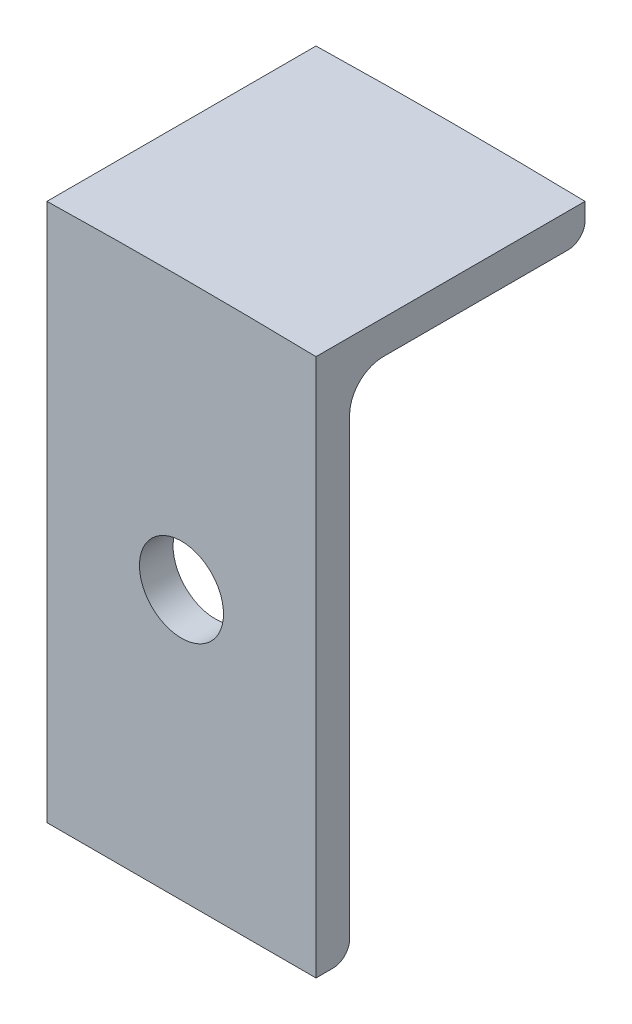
ISO-10303-21;
HEADER;
FILE_DESCRIPTION(('STEP AP214'),'2;1');
FILE_NAME('part.step','',(''),(''),'','','');
FILE_SCHEMA(('AUTOMOTIVE_DESIGN { 1 0 10303 214 1 1 1 1 }'));
ENDSEC;
DATA;
#1=APPLICATION_CONTEXT('core data for automotive mechanical design processes');
#2=APPLICATION_PROTOCOL_DEFINITION('international standard','automotive_design',2000,#1);
#3=PRODUCT_CONTEXT('',#1,'mechanical');
#4=PRODUCT('Part','Part','',(#3));
#5=PRODUCT_RELATED_PRODUCT_CATEGORY('part','',(#4));
#6=PRODUCT_DEFINITION_FORMATION('','',#4);
#7=PRODUCT_DEFINITION_CONTEXT('part definition',#1,'design');
#8=PRODUCT_DEFINITION('design','',#6,#7);
#9=PRODUCT_DEFINITION_SHAPE('','',#8);
#10=(LENGTH_UNIT() NAMED_UNIT(*) SI_UNIT(.MILLI.,.METRE.));
#11=(NAMED_UNIT(*) PLANE_ANGLE_UNIT() SI_UNIT($,.RADIAN.));
#12=(NAMED_UNIT(*) SI_UNIT($,.STERADIAN.) SOLID_ANGLE_UNIT());
#13=UNCERTAINTY_MEASURE_WITH_UNIT(LENGTH_MEASURE(1.E-05),#10,'distance_accuracy_value','');
#14=(GEOMETRIC_REPRESENTATION_CONTEXT(3) GLOBAL_UNCERTAINTY_ASSIGNED_CONTEXT((#13)) GLOBAL_UNIT_ASSIGNED_CONTEXT((#10,
#11,#12)) REPRESENTATION_CONTEXT('',''));
#15=CARTESIAN_POINT('',(0.,0.,0.));
#16=DIRECTION('',(0.,0.,1.));
#17=DIRECTION('',(1.,0.,0.));
#18=AXIS2_PLACEMENT_3D('',#15,#16,#17);
#19=CARTESIAN_POINT('',(12.7,0.,0.));
#20=DIRECTION('',(0.,0.,-1.));
#21=DIRECTION('',(-1.,0.,0.));
#22=AXIS2_PLACEMENT_3D('',#19,#20,#21);
#23=PLANE('',#22);
#24=DIRECTION('',(0.,-1.,0.));
#25=VECTOR('',#24,1.);
#26=CARTESIAN_POINT('',(-12.7,0.,0.));
#27=LINE('',#26,#25);
#28=CARTESIAN_POINT('',(-12.7,50.8,0.));
#29=VERTEX_POINT('',#28);
#30=CARTESIAN_POINT('',(-12.7,0.,0.));
#31=VERTEX_POINT('',#30);
#32=EDGE_CURVE('E87',#29,#31,#27,.T.);
#33=ORIENTED_EDGE('',*,*,#32,.T.);
#34=DIRECTION('',(-1.,0.,0.));
#35=VECTOR('',#34,1.);
#36=CARTESIAN_POINT('',(12.7,0.,0.));
#37=LINE('',#36,#35);
#38=CARTESIAN_POINT('',(12.7,0.,0.));
#39=VERTEX_POINT('',#38);
#40=EDGE_CURVE('E150',#39,#31,#37,.T.);
#41=ORIENTED_EDGE('',*,*,#40,.F.);
#42=DIRECTION('',(0.,-1.,0.));
#43=VECTOR('',#42,1.);
#44=CARTESIAN_POINT('',(12.7,0.,0.));
#45=LINE('',#44,#43);
#46=CARTESIAN_POINT('',(12.7,50.8,0.));
#47=VERTEX_POINT('',#46);
#48=EDGE_CURVE('E50',#47,#39,#45,.T.);
#49=ORIENTED_EDGE('',*,*,#48,.F.);
#50=CARTESIAN_POINT('',(0.,-552.316300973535,0.));
#51=DIRECTION('',(0.,0.,1.));
#52=DIRECTION('',(-1.,0.,0.));
#53=AXIS2_PLACEMENT_3D('',#50,#51,#52);
#54=CIRCLE('',#53,603.25);
#55=EDGE_CURVE('E126',#47,#29,#54,.T.);
#56=ORIENTED_EDGE('',*,*,#55,.T.);
#57=EDGE_LOOP('',(#33,#41,#49,#56));
#58=FACE_BOUND('',#57,.T.);
#59=CARTESIAN_POINT('',(0.,25.4,0.));
#60=DIRECTION('',(0.,0.,1.));
#61=DIRECTION('',(1.,0.,0.));
#62=AXIS2_PLACEMENT_3D('',#59,#60,#61);
#63=CIRCLE('',#62,3.96874999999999);
#64=CARTESIAN_POINT('',(3.96874999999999,25.4,0.));
#65=VERTEX_POINT('',#64);
#66=EDGE_CURVE('E129',#65,#65,#63,.T.);
#67=ORIENTED_EDGE('',*,*,#66,.F.);
#68=EDGE_LOOP('',(#67));
#69=FACE_BOUND('',#68,.T.);
#70=ADVANCED_FACE('F33',(#58,#69),#23,.F.);
#71=CARTESIAN_POINT('',(12.7,0.,-1.58749999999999));
#72=DIRECTION('',(0.,1.,0.));
#73=DIRECTION('',(0.,0.,1.));
#74=AXIS2_PLACEMENT_3D('',#71,#72,#73);
#75=PLANE('',#74);
#76=DIRECTION('',(0.,0.,-1.));
#77=VECTOR('',#76,1.);
#78=CARTESIAN_POINT('',(-12.7,0.,-1.58749999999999));
#79=LINE('',#78,#77);
#80=CARTESIAN_POINT('',(-12.7,0.,-1.58749999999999));
#81=VERTEX_POINT('',#80);
#82=EDGE_CURVE('E138',#31,#81,#79,.T.);
#83=ORIENTED_EDGE('',*,*,#82,.T.);
#84=DIRECTION('',(-1.,0.,0.));
#85=VECTOR('',#84,1.);
#86=CARTESIAN_POINT('',(12.7,0.,-1.58749999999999));
#87=LINE('',#86,#85);
#88=CARTESIAN_POINT('',(12.7,0.,-1.58749999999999));
#89=VERTEX_POINT('',#88);
#90=EDGE_CURVE('E11',#89,#81,#87,.T.);
#91=ORIENTED_EDGE('',*,*,#90,.F.);
#92=DIRECTION('',(0.,0.,-1.));
#93=VECTOR('',#92,1.);
#94=CARTESIAN_POINT('',(12.7,0.,-1.58749999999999));
#95=LINE('',#94,#93);
#96=EDGE_CURVE('E139',#39,#89,#95,.T.);
#97=ORIENTED_EDGE('',*,*,#96,.F.);
#98=ORIENTED_EDGE('',*,*,#40,.T.);
#99=EDGE_LOOP('',(#83,#91,#97,#98));
#100=FACE_BOUND('',#99,.T.);
#101=ADVANCED_FACE('F35',(#100),#75,.F.);
#102=CARTESIAN_POINT('',(12.7,1.5875,-1.5875));
#103=DIRECTION('',(-1.,0.,0.));
#104=DIRECTION('',(0.,0.,1.));
#105=AXIS2_PLACEMENT_3D('',#102,#103,#104);
#106=CYLINDRICAL_SURFACE('',#105,1.5875);
#107=CARTESIAN_POINT('',(-12.7,1.5875,-1.5875));
#108=DIRECTION('',(1.,0.,0.));
#109=DIRECTION('',(0.,0.,1.));
#110=AXIS2_PLACEMENT_3D('',#107,#108,#109);
#111=CIRCLE('',#110,1.5875);
#112=CARTESIAN_POINT('',(-12.7,1.58750000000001,-3.175));
#113=VERTEX_POINT('',#112);
#114=EDGE_CURVE('E153',#81,#113,#111,.T.);
#115=ORIENTED_EDGE('',*,*,#114,.T.);
#116=DIRECTION('',(-1.,0.,0.));
#117=VECTOR('',#116,1.);
#118=CARTESIAN_POINT('',(12.7,1.58750000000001,-3.175));
#119=LINE('',#118,#117);
#120=CARTESIAN_POINT('',(12.7,1.58750000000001,-3.175));
#121=VERTEX_POINT('',#120);
#122=EDGE_CURVE('E42',#121,#113,#119,.T.);
#123=ORIENTED_EDGE('',*,*,#122,.F.);
#124=CARTESIAN_POINT('',(12.7,1.5875,-1.5875));
#125=DIRECTION('',(1.,0.,0.));
#126=DIRECTION('',(0.,0.,1.));
#127=AXIS2_PLACEMENT_3D('',#124,#125,#126);
#128=CIRCLE('',#127,1.5875);
#129=EDGE_CURVE('E95',#89,#121,#128,.T.);
#130=ORIENTED_EDGE('',*,*,#129,.F.);
#131=ORIENTED_EDGE('',*,*,#90,.T.);
#132=EDGE_LOOP('',(#115,#123,#130,#131));
#133=FACE_BOUND('',#132,.T.);
#134=ADVANCED_FACE('F201',(#133),#106,.T.);
#135=CARTESIAN_POINT('',(12.7,44.45,-3.17499999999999));
#136=DIRECTION('',(0.,0.,1.));
#137=DIRECTION('',(0.,-1.,0.));
#138=AXIS2_PLACEMENT_3D('',#135,#136,#137);
#139=PLANE('',#138);
#140=CARTESIAN_POINT('',(0.,25.4,-3.17499999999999));
#141=DIRECTION('',(0.,0.,1.));
#142=DIRECTION('',(0.,-1.,0.));
#143=AXIS2_PLACEMENT_3D('',#140,#141,#142);
#144=CIRCLE('',#143,3.96874999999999);
#145=CARTESIAN_POINT('',(0.,21.43125,-3.175));
#146=VERTEX_POINT('',#145);
#147=EDGE_CURVE('E132',#146,#146,#144,.T.);
#148=ORIENTED_EDGE('',*,*,#147,.T.);
#149=EDGE_LOOP('',(#148));
#150=FACE_BOUND('',#149,.T.);
#151=DIRECTION('',(0.,1.,0.));
#152=VECTOR('',#151,1.);
#153=CARTESIAN_POINT('',(-12.7,44.45,-3.17499999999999));
#154=LINE('',#153,#152);
#155=CARTESIAN_POINT('',(-12.7,44.45,-3.17499999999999));
#156=VERTEX_POINT('',#155);
#157=EDGE_CURVE('E155',#113,#156,#154,.T.);
#158=ORIENTED_EDGE('',*,*,#157,.T.);
#159=DIRECTION('',(-1.,0.,0.));
#160=VECTOR('',#159,1.);
#161=CARTESIAN_POINT('',(12.7,44.45,-3.17499999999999));
#162=LINE('',#161,#160);
#163=CARTESIAN_POINT('',(12.7,44.45,-3.17499999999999));
#164=VERTEX_POINT('',#163);
#165=EDGE_CURVE('E176',#164,#156,#162,.T.);
#166=ORIENTED_EDGE('',*,*,#165,.F.);
#167=DIRECTION('',(0.,1.,0.));
#168=VECTOR('',#167,1.);
#169=CARTESIAN_POINT('',(12.7,44.45,-3.17499999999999));
#170=LINE('',#169,#168);
#171=EDGE_CURVE('E142',#121,#164,#170,.T.);
#172=ORIENTED_EDGE('',*,*,#171,.F.);
#173=ORIENTED_EDGE('',*,*,#122,.T.);
#174=EDGE_LOOP('',(#158,#166,#172,#173));
#175=FACE_BOUND('',#174,.T.);
#176=ADVANCED_FACE('F182',(#150,#175),#139,.F.);
#177=CARTESIAN_POINT('',(12.7,44.45,-6.34999999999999));
#178=DIRECTION('',(-1.,0.,0.));
#179=DIRECTION('',(0.,0.,1.));
#180=AXIS2_PLACEMENT_3D('',#177,#178,#179);
#181=CYLINDRICAL_SURFACE('',#180,3.175);
#182=CARTESIAN_POINT('',(-12.7,44.45,-6.34999999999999));
#183=DIRECTION('',(-1.,0.,0.));
#184=DIRECTION('',(0.,0.,-1.));
#185=AXIS2_PLACEMENT_3D('',#182,#183,#184);
#186=CIRCLE('',#185,3.175);
#187=CARTESIAN_POINT('',(-12.7,47.625,-6.35000000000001));
#188=VERTEX_POINT('',#187);
#189=EDGE_CURVE('E157',#156,#188,#186,.T.);
#190=ORIENTED_EDGE('',*,*,#189,.T.);
#191=DIRECTION('',(-1.,0.,0.));
#192=VECTOR('',#191,1.);
#193=CARTESIAN_POINT('',(12.7,47.625,-6.35000000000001));
#194=LINE('',#193,#192);
#195=CARTESIAN_POINT('',(12.7,47.625,-6.35000000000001));
#196=VERTEX_POINT('',#195);
#197=EDGE_CURVE('E173',#196,#188,#194,.T.);
#198=ORIENTED_EDGE('',*,*,#197,.F.);
#199=CARTESIAN_POINT('',(12.7,44.45,-6.34999999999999));
#200=DIRECTION('',(-1.,0.,0.));
#201=DIRECTION('',(0.,0.,-1.));
#202=AXIS2_PLACEMENT_3D('',#199,#200,#201);
#203=CIRCLE('',#202,3.175);
#204=EDGE_CURVE('E144',#164,#196,#203,.T.);
#205=ORIENTED_EDGE('',*,*,#204,.F.);
#206=ORIENTED_EDGE('',*,*,#165,.T.);
#207=EDGE_LOOP('',(#190,#198,#205,#206));
#208=FACE_BOUND('',#207,.T.);
#209=ADVANCED_FACE('F192',(#208),#181,.F.);
#210=CARTESIAN_POINT('',(12.7,47.625,-23.8125));
#211=DIRECTION('',(0.,1.,0.));
#212=DIRECTION('',(0.,0.,1.));
#213=AXIS2_PLACEMENT_3D('',#210,#211,#212);
#214=PLANE('',#213);
#215=DIRECTION('',(0.,0.,-1.));
#216=VECTOR('',#215,1.);
#217=CARTESIAN_POINT('',(-12.7,47.625,-23.8125));
#218=LINE('',#217,#216);
#219=CARTESIAN_POINT('',(-12.7,47.625,-23.8125));
#220=VERTEX_POINT('',#219);
#221=EDGE_CURVE('E159',#188,#220,#218,.T.);
#222=ORIENTED_EDGE('',*,*,#221,.T.);
#223=DIRECTION('',(-1.,0.,0.));
#224=VECTOR('',#223,1.);
#225=CARTESIAN_POINT('',(12.7,47.625,-23.8125));
#226=LINE('',#225,#224);
#227=CARTESIAN_POINT('',(12.7,47.625,-23.8125));
#228=VERTEX_POINT('',#227);
#229=EDGE_CURVE('E170',#228,#220,#226,.T.);
#230=ORIENTED_EDGE('',*,*,#229,.F.);
#231=DIRECTION('',(0.,0.,-1.));
#232=VECTOR('',#231,1.);
#233=CARTESIAN_POINT('',(12.7,47.625,-23.8125));
#234=LINE('',#233,#232);
#235=EDGE_CURVE('E146',#196,#228,#234,.T.);
#236=ORIENTED_EDGE('',*,*,#235,.F.);
#237=ORIENTED_EDGE('',*,*,#197,.T.);
#238=EDGE_LOOP('',(#222,#230,#236,#237));
#239=FACE_BOUND('',#238,.T.);
#240=ADVANCED_FACE('F196',(#239),#214,.F.);
#241=CARTESIAN_POINT('',(12.7,49.2125,-23.8125));
#242=DIRECTION('',(-1.,0.,0.));
#243=DIRECTION('',(0.,0.,1.));
#244=AXIS2_PLACEMENT_3D('',#241,#242,#243);
#245=CYLINDRICAL_SURFACE('',#244,1.5875);
#246=CARTESIAN_POINT('',(-12.7,49.2125,-23.8125));
#247=DIRECTION('',(1.,0.,0.));
#248=DIRECTION('',(0.,0.,1.));
#249=AXIS2_PLACEMENT_3D('',#246,#247,#248);
#250=CIRCLE('',#249,1.5875);
#251=CARTESIAN_POINT('',(-12.7,49.2125,-25.4));
#252=VERTEX_POINT('',#251);
#253=EDGE_CURVE('E161',#220,#252,#250,.T.);
#254=ORIENTED_EDGE('',*,*,#253,.T.);
#255=DIRECTION('',(-1.,0.,0.));
#256=VECTOR('',#255,1.);
#257=CARTESIAN_POINT('',(12.7,49.2125,-25.4));
#258=LINE('',#257,#256);
#259=CARTESIAN_POINT('',(12.7,49.2125,-25.4));
#260=VERTEX_POINT('',#259);
#261=EDGE_CURVE('E168',#260,#252,#258,.T.);
#262=ORIENTED_EDGE('',*,*,#261,.F.);
#263=CARTESIAN_POINT('',(12.7,49.2125,-23.8125));
#264=DIRECTION('',(1.,0.,0.));
#265=DIRECTION('',(0.,0.,1.));
#266=AXIS2_PLACEMENT_3D('',#263,#264,#265);
#267=CIRCLE('',#266,1.5875);
#268=EDGE_CURVE('E117',#228,#260,#267,.T.);
#269=ORIENTED_EDGE('',*,*,#268,.F.);
#270=ORIENTED_EDGE('',*,*,#229,.T.);
#271=EDGE_LOOP('',(#254,#262,#269,#270));
#272=FACE_BOUND('',#271,.T.);
#273=ADVANCED_FACE('F220',(#272),#245,.T.);
#274=CARTESIAN_POINT('',(12.7,50.8,-25.4));
#275=DIRECTION('',(0.,0.,1.));
#276=DIRECTION('',(1.,0.,0.));
#277=AXIS2_PLACEMENT_3D('',#274,#275,#276);
#278=PLANE('',#277);
#279=DIRECTION('',(0.,1.,0.));
#280=VECTOR('',#279,1.);
#281=CARTESIAN_POINT('',(-12.7,50.8,-25.4));
#282=LINE('',#281,#280);
#283=CARTESIAN_POINT('',(-12.7,50.8,-25.4));
#284=VERTEX_POINT('',#283);
#285=EDGE_CURVE('E80',#252,#284,#282,.T.);
#286=ORIENTED_EDGE('',*,*,#285,.T.);
#287=CARTESIAN_POINT('',(0.,-552.316300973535,-25.4));
#288=DIRECTION('',(0.,0.,1.));
#289=DIRECTION('',(-1.,0.,0.));
#290=AXIS2_PLACEMENT_3D('',#287,#288,#289);
#291=CIRCLE('',#290,603.25);
#292=CARTESIAN_POINT('',(12.7,50.8,-25.4));
#293=VERTEX_POINT('',#292);
#294=EDGE_CURVE('E125',#293,#284,#291,.T.);
#295=ORIENTED_EDGE('',*,*,#294,.F.);
#296=DIRECTION('',(0.,1.,0.));
#297=VECTOR('',#296,1.);
#298=CARTESIAN_POINT('',(12.7,50.8,-25.4));
#299=LINE('',#298,#297);
#300=EDGE_CURVE('E112',#260,#293,#299,.T.);
#301=ORIENTED_EDGE('',*,*,#300,.F.);
#302=ORIENTED_EDGE('',*,*,#261,.T.);
#303=EDGE_LOOP('',(#286,#295,#301,#302));
#304=FACE_BOUND('',#303,.T.);
#305=ADVANCED_FACE('F128',(#304),#278,.F.);
#306=CARTESIAN_POINT('',(12.7,49.2125,-23.8125));
#307=DIRECTION('',(-1.,0.,0.));
#308=DIRECTION('',(0.,0.,1.));
#309=AXIS2_PLACEMENT_3D('',#306,#307,#308);
#310=PLANE('',#309);
#311=ORIENTED_EDGE('',*,*,#96,.T.);
#312=ORIENTED_EDGE('',*,*,#129,.T.);
#313=ORIENTED_EDGE('',*,*,#171,.T.);
#314=ORIENTED_EDGE('',*,*,#204,.T.);
#315=ORIENTED_EDGE('',*,*,#235,.T.);
#316=ORIENTED_EDGE('',*,*,#268,.T.);
#317=ORIENTED_EDGE('',*,*,#300,.T.);
#318=DIRECTION('',(0.,0.,1.));
#319=VECTOR('',#318,1.);
#320=CARTESIAN_POINT('',(12.7,50.8,0.));
#321=LINE('',#320,#319);
#322=EDGE_CURVE('E115',#293,#47,#321,.T.);
#323=ORIENTED_EDGE('',*,*,#322,.T.);
#324=ORIENTED_EDGE('',*,*,#48,.T.);
#325=EDGE_LOOP('',(#311,#312,#313,#314,#315,#316,#317,#323,#324));
#326=FACE_BOUND('',#325,.T.);
#327=ADVANCED_FACE('F114',(#326),#310,.F.);
#328=CARTESIAN_POINT('',(-12.7,49.2125,-23.8125));
#329=DIRECTION('',(-1.,0.,0.));
#330=DIRECTION('',(0.,0.,1.));
#331=AXIS2_PLACEMENT_3D('',#328,#329,#330);
#332=PLANE('',#331);
#333=ORIENTED_EDGE('',*,*,#82,.F.);
#334=ORIENTED_EDGE('',*,*,#32,.F.);
#335=DIRECTION('',(0.,0.,1.));
#336=VECTOR('',#335,1.);
#337=CARTESIAN_POINT('',(-12.7,50.8,0.));
#338=LINE('',#337,#336);
#339=EDGE_CURVE('E164',#284,#29,#338,.T.);
#340=ORIENTED_EDGE('',*,*,#339,.F.);
#341=ORIENTED_EDGE('',*,*,#285,.F.);
#342=ORIENTED_EDGE('',*,*,#253,.F.);
#343=ORIENTED_EDGE('',*,*,#221,.F.);
#344=ORIENTED_EDGE('',*,*,#189,.F.);
#345=ORIENTED_EDGE('',*,*,#157,.F.);
#346=ORIENTED_EDGE('',*,*,#114,.F.);
#347=EDGE_LOOP('',(#333,#334,#340,#341,#342,#343,#344,#345,#346));
#348=FACE_BOUND('',#347,.T.);
#349=ADVANCED_FACE('F187',(#348),#332,.T.);
#350=CARTESIAN_POINT('',(0.,25.4,0.));
#351=DIRECTION('',(0.,0.,1.));
#352=DIRECTION('',(1.,0.,0.));
#353=AXIS2_PLACEMENT_3D('',#350,#351,#352);
#354=CYLINDRICAL_SURFACE('',#353,3.96874999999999);
#355=ORIENTED_EDGE('',*,*,#147,.F.);
#356=EDGE_LOOP('',(#355));
#357=FACE_BOUND('',#356,.T.);
#358=ORIENTED_EDGE('',*,*,#66,.T.);
#359=EDGE_LOOP('',(#358));
#360=FACE_BOUND('',#359,.T.);
#361=ADVANCED_FACE('F254',(#357,#360),#354,.F.);
#362=CARTESIAN_POINT('',(0.,-552.316300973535,-25.4));
#363=DIRECTION('',(0.,0.,1.));
#364=DIRECTION('',(1.,0.,0.));
#365=AXIS2_PLACEMENT_3D('',#362,#363,#364);
#366=CYLINDRICAL_SURFACE('',#365,603.25);
#367=ORIENTED_EDGE('',*,*,#55,.F.);
#368=ORIENTED_EDGE('',*,*,#322,.F.);
#369=ORIENTED_EDGE('',*,*,#294,.T.);
#370=ORIENTED_EDGE('',*,*,#339,.T.);
#371=EDGE_LOOP('',(#367,#368,#369,#370));
#372=FACE_BOUND('',#371,.T.);
#373=ADVANCED_FACE('F123',(#372),#366,.T.);
#374=CLOSED_SHELL('',(#70,#101,#134,#176,#209,#240,#273,#305,#327,#349,#361,#373));
#375=MANIFOLD_SOLID_BREP('B2',#374);
#376=ADVANCED_BREP_SHAPE_REPRESENTATION('',(#18,#375),#14);
#377=SHAPE_DEFINITION_REPRESENTATION(#9,#376);
ENDSEC;
END-ISO-10303-21;
